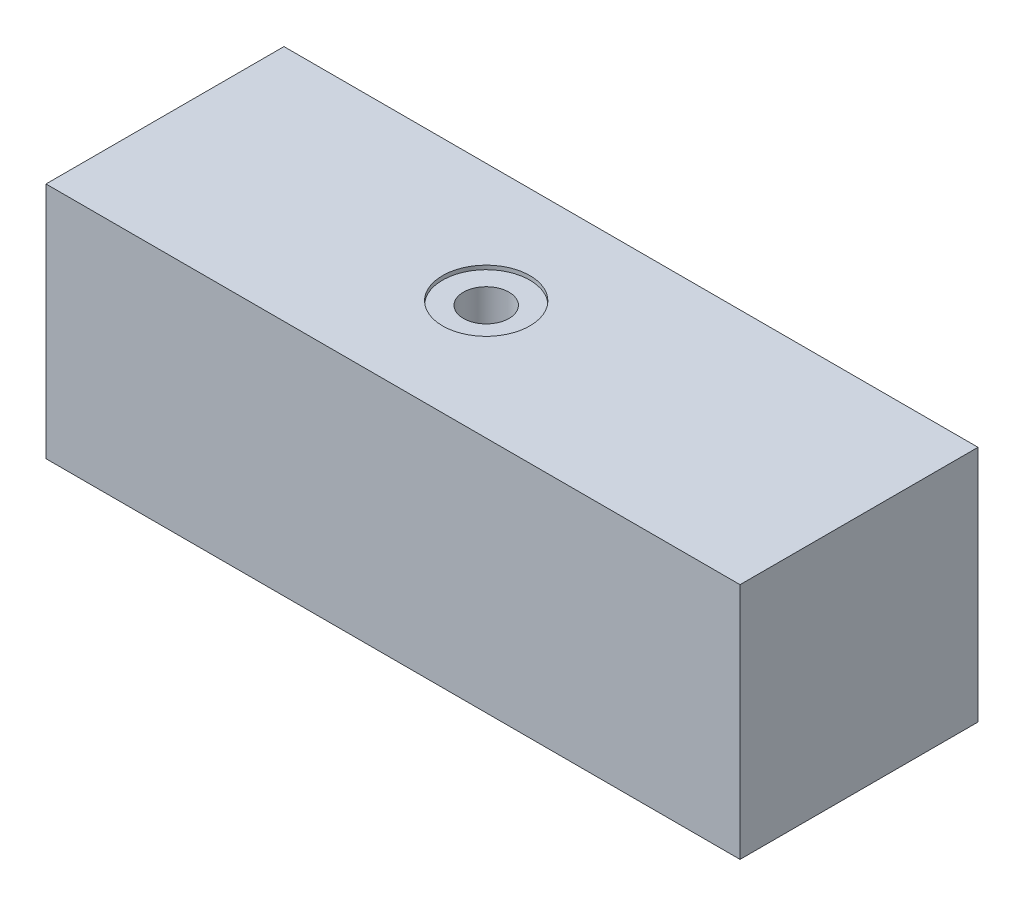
ISO-10303-21;
HEADER;
FILE_DESCRIPTION(('STEP AP214'),'2;1');
FILE_NAME('part.step','',(''),(''),'','','');
FILE_SCHEMA(('AUTOMOTIVE_DESIGN { 1 0 10303 214 1 1 1 1 }'));
ENDSEC;
DATA;
#1=APPLICATION_CONTEXT('core data for automotive mechanical design processes');
#2=APPLICATION_PROTOCOL_DEFINITION('international standard','automotive_design',2000,#1);
#3=PRODUCT_CONTEXT('',#1,'mechanical');
#4=PRODUCT('Part','Part','',(#3));
#5=PRODUCT_RELATED_PRODUCT_CATEGORY('part','',(#4));
#6=PRODUCT_DEFINITION_FORMATION('','',#4);
#7=PRODUCT_DEFINITION_CONTEXT('part definition',#1,'design');
#8=PRODUCT_DEFINITION('design','',#6,#7);
#9=PRODUCT_DEFINITION_SHAPE('','',#8);
#10=(LENGTH_UNIT() NAMED_UNIT(*) SI_UNIT(.MILLI.,.METRE.));
#11=(NAMED_UNIT(*) PLANE_ANGLE_UNIT() SI_UNIT($,.RADIAN.));
#12=(NAMED_UNIT(*) SI_UNIT($,.STERADIAN.) SOLID_ANGLE_UNIT());
#13=UNCERTAINTY_MEASURE_WITH_UNIT(LENGTH_MEASURE(1.E-05),#10,'distance_accuracy_value','');
#14=(GEOMETRIC_REPRESENTATION_CONTEXT(3) GLOBAL_UNCERTAINTY_ASSIGNED_CONTEXT((#13)) GLOBAL_UNIT_ASSIGNED_CONTEXT((#10,
#11,#12)) REPRESENTATION_CONTEXT('',''));
#15=CARTESIAN_POINT('',(0.,0.,0.));
#16=DIRECTION('',(0.,0.,1.));
#17=DIRECTION('',(1.,0.,0.));
#18=AXIS2_PLACEMENT_3D('',#15,#16,#17);
#19=CARTESIAN_POINT('',(87.5,34.,60.));
#20=DIRECTION('',(0.,-1.,0.));
#21=DIRECTION('',(1.,0.,0.));
#22=AXIS2_PLACEMENT_3D('',#19,#20,#21);
#23=PLANE('',#22);
#24=CARTESIAN_POINT('',(-6.49999999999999,34.,30.));
#25=DIRECTION('',(0.,1.,0.));
#26=DIRECTION('',(0.,0.,1.));
#27=AXIS2_PLACEMENT_3D('',#24,#25,#26);
#28=CIRCLE('',#27,11.);
#29=CARTESIAN_POINT('',(-6.49999999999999,34.,41.));
#30=VERTEX_POINT('',#29);
#31=EDGE_CURVE('E129',#30,#30,#28,.T.);
#32=ORIENTED_EDGE('',*,*,#31,.F.);
#33=EDGE_LOOP('',(#32));
#34=FACE_BOUND('',#33,.T.);
#35=DIRECTION('',(-1.,0.,0.));
#36=VECTOR('',#35,1.);
#37=CARTESIAN_POINT('',(87.5,34.,0.));
#38=LINE('',#37,#36);
#39=CARTESIAN_POINT('',(87.5,34.,0.));
#40=VERTEX_POINT('',#39);
#41=CARTESIAN_POINT('',(-87.5,34.,0.));
#42=VERTEX_POINT('',#41);
#43=EDGE_CURVE('E77',#40,#42,#38,.T.);
#44=ORIENTED_EDGE('',*,*,#43,.T.);
#45=DIRECTION('',(0.,0.,-1.));
#46=VECTOR('',#45,1.);
#47=CARTESIAN_POINT('',(-87.5,34.,60.));
#48=LINE('',#47,#46);
#49=CARTESIAN_POINT('',(-87.5,34.,60.));
#50=VERTEX_POINT('',#49);
#51=EDGE_CURVE('E11',#50,#42,#48,.T.);
#52=ORIENTED_EDGE('',*,*,#51,.F.);
#53=DIRECTION('',(-1.,0.,0.));
#54=VECTOR('',#53,1.);
#55=CARTESIAN_POINT('',(87.5,34.,60.));
#56=LINE('',#55,#54);
#57=CARTESIAN_POINT('',(87.5,34.,60.));
#58=VERTEX_POINT('',#57);
#59=EDGE_CURVE('E100',#58,#50,#56,.T.);
#60=ORIENTED_EDGE('',*,*,#59,.F.);
#61=DIRECTION('',(0.,0.,-1.));
#62=VECTOR('',#61,1.);
#63=CARTESIAN_POINT('',(87.5,34.,60.));
#64=LINE('',#63,#62);
#65=EDGE_CURVE('E89',#58,#40,#64,.T.);
#66=ORIENTED_EDGE('',*,*,#65,.T.);
#67=EDGE_LOOP('',(#44,#52,#60,#66));
#68=FACE_BOUND('',#67,.T.);
#69=ADVANCED_FACE('F33',(#34,#68),#23,.F.);
#70=CARTESIAN_POINT('',(-87.5,34.,60.));
#71=DIRECTION('',(1.,0.,0.));
#72=DIRECTION('',(0.,1.,0.));
#73=AXIS2_PLACEMENT_3D('',#70,#71,#72);
#74=PLANE('',#73);
#75=DIRECTION('',(0.,-1.,0.));
#76=VECTOR('',#75,1.);
#77=CARTESIAN_POINT('',(-87.5,34.,0.));
#78=LINE('',#77,#76);
#79=CARTESIAN_POINT('',(-87.5,-26.,0.));
#80=VERTEX_POINT('',#79);
#81=EDGE_CURVE('E73',#42,#80,#78,.T.);
#82=ORIENTED_EDGE('',*,*,#81,.T.);
#83=DIRECTION('',(0.,0.,-1.));
#84=VECTOR('',#83,1.);
#85=CARTESIAN_POINT('',(-87.5,-26.,60.));
#86=LINE('',#85,#84);
#87=CARTESIAN_POINT('',(-87.5,-26.,60.));
#88=VERTEX_POINT('',#87);
#89=EDGE_CURVE('E40',#88,#80,#86,.T.);
#90=ORIENTED_EDGE('',*,*,#89,.F.);
#91=DIRECTION('',(0.,-1.,0.));
#92=VECTOR('',#91,1.);
#93=CARTESIAN_POINT('',(-87.5,34.,60.));
#94=LINE('',#93,#92);
#95=EDGE_CURVE('E85',#50,#88,#94,.T.);
#96=ORIENTED_EDGE('',*,*,#95,.F.);
#97=ORIENTED_EDGE('',*,*,#51,.T.);
#98=EDGE_LOOP('',(#82,#90,#96,#97));
#99=FACE_BOUND('',#98,.T.);
#100=ADVANCED_FACE('F84',(#99),#74,.F.);
#101=CARTESIAN_POINT('',(-87.5,-26.,60.));
#102=DIRECTION('',(0.,1.,0.));
#103=DIRECTION('',(0.,0.,1.));
#104=AXIS2_PLACEMENT_3D('',#101,#102,#103);
#105=PLANE('',#104);
#106=CARTESIAN_POINT('',(-6.49999999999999,-26.,30.));
#107=DIRECTION('',(0.,1.,0.));
#108=DIRECTION('',(0.,0.,1.));
#109=AXIS2_PLACEMENT_3D('',#106,#107,#108);
#110=CIRCLE('',#109,5.75000000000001);
#111=CARTESIAN_POINT('',(-6.49999999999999,-26.,35.75));
#112=VERTEX_POINT('',#111);
#113=EDGE_CURVE('E90',#112,#112,#110,.T.);
#114=ORIENTED_EDGE('',*,*,#113,.T.);
#115=EDGE_LOOP('',(#114));
#116=FACE_BOUND('',#115,.T.);
#117=DIRECTION('',(1.,0.,0.));
#118=VECTOR('',#117,1.);
#119=CARTESIAN_POINT('',(-87.5,-26.,0.));
#120=LINE('',#119,#118);
#121=CARTESIAN_POINT('',(87.5,-26.,0.));
#122=VERTEX_POINT('',#121);
#123=EDGE_CURVE('E78',#80,#122,#120,.T.);
#124=ORIENTED_EDGE('',*,*,#123,.T.);
#125=DIRECTION('',(0.,0.,-1.));
#126=VECTOR('',#125,1.);
#127=CARTESIAN_POINT('',(87.5,-26.,60.));
#128=LINE('',#127,#126);
#129=CARTESIAN_POINT('',(87.5,-26.,60.));
#130=VERTEX_POINT('',#129);
#131=EDGE_CURVE('E106',#130,#122,#128,.T.);
#132=ORIENTED_EDGE('',*,*,#131,.F.);
#133=DIRECTION('',(1.,0.,0.));
#134=VECTOR('',#133,1.);
#135=CARTESIAN_POINT('',(-87.5,-26.,60.));
#136=LINE('',#135,#134);
#137=EDGE_CURVE('E52',#88,#130,#136,.T.);
#138=ORIENTED_EDGE('',*,*,#137,.F.);
#139=ORIENTED_EDGE('',*,*,#89,.T.);
#140=EDGE_LOOP('',(#124,#132,#138,#139));
#141=FACE_BOUND('',#140,.T.);
#142=ADVANCED_FACE('F109',(#116,#141),#105,.F.);
#143=CARTESIAN_POINT('',(87.5,-26.,60.));
#144=DIRECTION('',(-1.,0.,0.));
#145=DIRECTION('',(0.,0.,1.));
#146=AXIS2_PLACEMENT_3D('',#143,#144,#145);
#147=PLANE('',#146);
#148=DIRECTION('',(0.,1.,0.));
#149=VECTOR('',#148,1.);
#150=CARTESIAN_POINT('',(87.5,-26.,0.));
#151=LINE('',#150,#149);
#152=EDGE_CURVE('E98',#122,#40,#151,.T.);
#153=ORIENTED_EDGE('',*,*,#152,.T.);
#154=ORIENTED_EDGE('',*,*,#65,.F.);
#155=DIRECTION('',(0.,1.,0.));
#156=VECTOR('',#155,1.);
#157=CARTESIAN_POINT('',(87.5,-26.,60.));
#158=LINE('',#157,#156);
#159=EDGE_CURVE('E47',#130,#58,#158,.T.);
#160=ORIENTED_EDGE('',*,*,#159,.F.);
#161=ORIENTED_EDGE('',*,*,#131,.T.);
#162=EDGE_LOOP('',(#153,#154,#160,#161));
#163=FACE_BOUND('',#162,.T.);
#164=ADVANCED_FACE('F111',(#163),#147,.F.);
#165=CARTESIAN_POINT('',(-87.5,34.,60.));
#166=DIRECTION('',(0.,0.,1.));
#167=DIRECTION('',(1.,0.,0.));
#168=AXIS2_PLACEMENT_3D('',#165,#166,#167);
#169=PLANE('',#168);
#170=ORIENTED_EDGE('',*,*,#59,.T.);
#171=ORIENTED_EDGE('',*,*,#95,.T.);
#172=ORIENTED_EDGE('',*,*,#137,.T.);
#173=ORIENTED_EDGE('',*,*,#159,.T.);
#174=EDGE_LOOP('',(#170,#171,#172,#173));
#175=FACE_BOUND('',#174,.T.);
#176=ADVANCED_FACE('F112',(#175),#169,.T.);
#177=CARTESIAN_POINT('',(-87.5,34.,0.));
#178=DIRECTION('',(0.,0.,1.));
#179=DIRECTION('',(1.,0.,0.));
#180=AXIS2_PLACEMENT_3D('',#177,#178,#179);
#181=PLANE('',#180);
#182=ORIENTED_EDGE('',*,*,#43,.F.);
#183=ORIENTED_EDGE('',*,*,#152,.F.);
#184=ORIENTED_EDGE('',*,*,#123,.F.);
#185=ORIENTED_EDGE('',*,*,#81,.F.);
#186=EDGE_LOOP('',(#182,#183,#184,#185));
#187=FACE_BOUND('',#186,.T.);
#188=ADVANCED_FACE('F74',(#187),#181,.F.);
#189=CARTESIAN_POINT('',(-6.49999999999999,34.,30.));
#190=DIRECTION('',(0.,1.,0.));
#191=DIRECTION('',(0.,0.,1.));
#192=AXIS2_PLACEMENT_3D('',#189,#190,#191);
#193=CYLINDRICAL_SURFACE('',#192,5.75000000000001);
#194=ORIENTED_EDGE('',*,*,#113,.F.);
#195=EDGE_LOOP('',(#194));
#196=FACE_BOUND('',#195,.T.);
#197=CARTESIAN_POINT('',(-6.49999999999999,33.,30.));
#198=DIRECTION('',(0.,1.,0.));
#199=DIRECTION('',(0.,0.,1.));
#200=AXIS2_PLACEMENT_3D('',#197,#198,#199);
#201=CIRCLE('',#200,5.75000000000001);
#202=CARTESIAN_POINT('',(-6.49999999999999,33.,35.75));
#203=VERTEX_POINT('',#202);
#204=EDGE_CURVE('E93',#203,#203,#201,.T.);
#205=ORIENTED_EDGE('',*,*,#204,.T.);
#206=EDGE_LOOP('',(#205));
#207=FACE_BOUND('',#206,.T.);
#208=ADVANCED_FACE('F119',(#196,#207),#193,.F.);
#209=CARTESIAN_POINT('',(-0.749999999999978,33.,30.));
#210=DIRECTION('',(0.,-1.,0.));
#211=DIRECTION('',(0.,0.,-1.));
#212=AXIS2_PLACEMENT_3D('',#209,#210,#211);
#213=PLANE('',#212);
#214=ORIENTED_EDGE('',*,*,#204,.F.);
#215=EDGE_LOOP('',(#214));
#216=FACE_BOUND('',#215,.T.);
#217=CARTESIAN_POINT('',(-6.49999999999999,33.,30.));
#218=DIRECTION('',(0.,1.,0.));
#219=DIRECTION('',(0.,0.,1.));
#220=AXIS2_PLACEMENT_3D('',#217,#218,#219);
#221=CIRCLE('',#220,11.);
#222=CARTESIAN_POINT('',(-6.49999999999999,33.,41.));
#223=VERTEX_POINT('',#222);
#224=EDGE_CURVE('E131',#223,#223,#221,.T.);
#225=ORIENTED_EDGE('',*,*,#224,.T.);
#226=EDGE_LOOP('',(#225));
#227=FACE_BOUND('',#226,.T.);
#228=ADVANCED_FACE('F139',(#216,#227),#213,.F.);
#229=CARTESIAN_POINT('',(-6.49999999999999,34.,30.));
#230=DIRECTION('',(0.,1.,0.));
#231=DIRECTION('',(0.,0.,1.));
#232=AXIS2_PLACEMENT_3D('',#229,#230,#231);
#233=CYLINDRICAL_SURFACE('',#232,11.);
#234=ORIENTED_EDGE('',*,*,#224,.F.);
#235=EDGE_LOOP('',(#234));
#236=FACE_BOUND('',#235,.T.);
#237=ORIENTED_EDGE('',*,*,#31,.T.);
#238=EDGE_LOOP('',(#237));
#239=FACE_BOUND('',#238,.T.);
#240=ADVANCED_FACE('F142',(#236,#239),#233,.F.);
#241=CLOSED_SHELL('',(#69,#100,#142,#164,#176,#188,#208,#228,#240));
#242=MANIFOLD_SOLID_BREP('B2',#241);
#243=ADVANCED_BREP_SHAPE_REPRESENTATION('',(#18,#242),#14);
#244=SHAPE_DEFINITION_REPRESENTATION(#9,#243);
ENDSEC;
END-ISO-10303-21;
